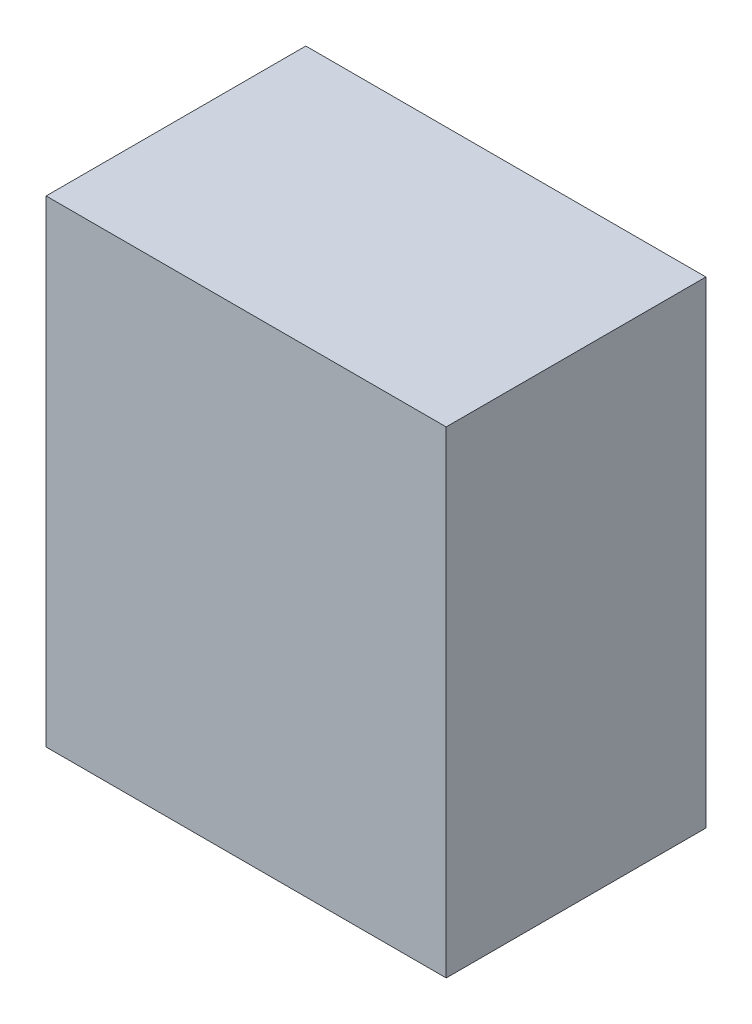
from build123d import *

# Parameters (mm, degrees)
SKETCH1_W           = 57
SKETCH1_H           = 37
BOSS_EXTRUDE1_DEPTH = 68


with BuildPart() as part:
    # Sketch1 → Boss-Extrude1 (new body)
    with BuildSketch(Plane(origin=(0, 0, 0), x_dir=(1, 0, 0), z_dir=(0, 1, 0))):
        Rectangle(SKETCH1_W, SKETCH1_H)
    extrude(amount=BOSS_EXTRUDE1_DEPTH)


solid = part.part
